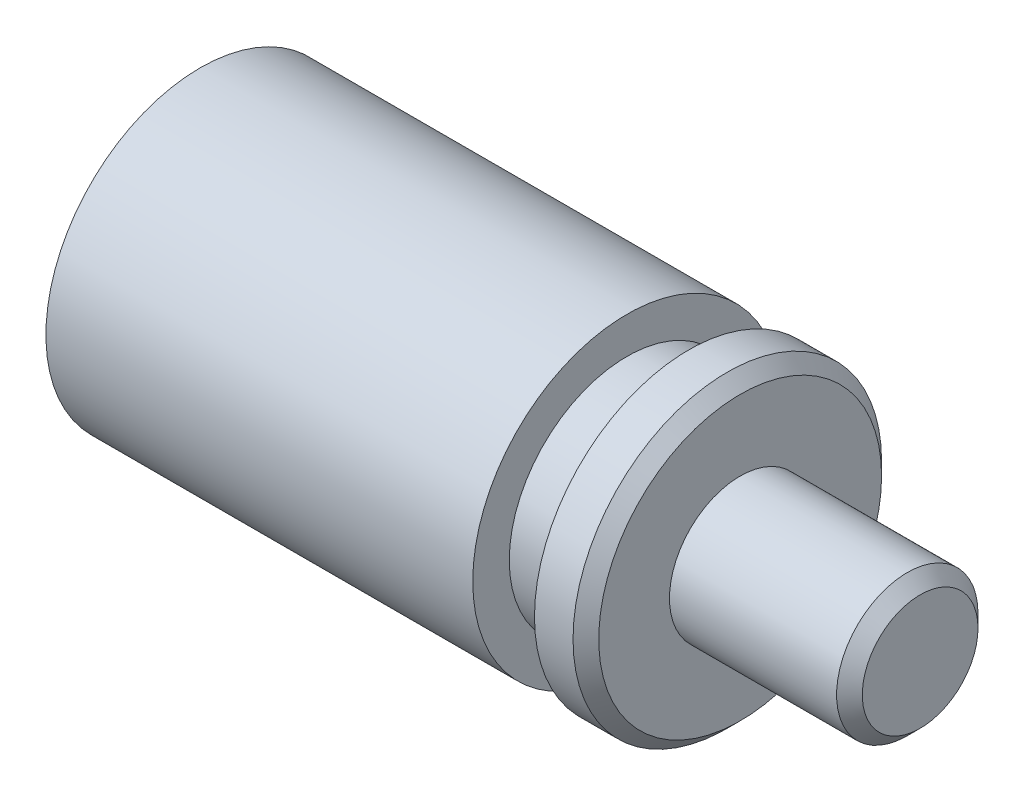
ISO-10303-21;
HEADER;
FILE_DESCRIPTION(('STEP AP214'),'2;1');
FILE_NAME('part.step','',(''),(''),'','','');
FILE_SCHEMA(('AUTOMOTIVE_DESIGN { 1 0 10303 214 1 1 1 1 }'));
ENDSEC;
DATA;
#1=APPLICATION_CONTEXT('core data for automotive mechanical design processes');
#2=APPLICATION_PROTOCOL_DEFINITION('international standard','automotive_design',2000,#1);
#3=PRODUCT_CONTEXT('',#1,'mechanical');
#4=PRODUCT('Part','Part','',(#3));
#5=PRODUCT_RELATED_PRODUCT_CATEGORY('part','',(#4));
#6=PRODUCT_DEFINITION_FORMATION('','',#4);
#7=PRODUCT_DEFINITION_CONTEXT('part definition',#1,'design');
#8=PRODUCT_DEFINITION('design','',#6,#7);
#9=PRODUCT_DEFINITION_SHAPE('','',#8);
#10=(LENGTH_UNIT() NAMED_UNIT(*) SI_UNIT(.MILLI.,.METRE.));
#11=(NAMED_UNIT(*) PLANE_ANGLE_UNIT() SI_UNIT($,.RADIAN.));
#12=(NAMED_UNIT(*) SI_UNIT($,.STERADIAN.) SOLID_ANGLE_UNIT());
#13=UNCERTAINTY_MEASURE_WITH_UNIT(LENGTH_MEASURE(1.E-05),#10,'distance_accuracy_value','');
#14=(GEOMETRIC_REPRESENTATION_CONTEXT(3) GLOBAL_UNCERTAINTY_ASSIGNED_CONTEXT((#13)) GLOBAL_UNIT_ASSIGNED_CONTEXT((#10,
#11,#12)) REPRESENTATION_CONTEXT('',''));
#15=CARTESIAN_POINT('',(0.,0.,0.));
#16=DIRECTION('',(0.,0.,1.));
#17=DIRECTION('',(1.,0.,0.));
#18=AXIS2_PLACEMENT_3D('',#15,#16,#17);
#19=CARTESIAN_POINT('',(0.,0.,0.));
#20=DIRECTION('',(1.,0.,0.));
#21=DIRECTION('',(0.,0.,-1.));
#22=AXIS2_PLACEMENT_3D('',#19,#20,#21);
#23=PLANE('',#22);
#24=CARTESIAN_POINT('',(0.,0.,0.));
#25=DIRECTION('',(1.,0.,0.));
#26=DIRECTION('',(0.,0.,-1.));
#27=AXIS2_PLACEMENT_3D('',#24,#25,#26);
#28=CIRCLE('',#27,2.25);
#29=CARTESIAN_POINT('',(0.,0.,-2.25));
#30=VERTEX_POINT('',#29);
#31=EDGE_CURVE('E46',#30,#30,#28,.T.);
#32=ORIENTED_EDGE('',*,*,#31,.T.);
#33=EDGE_LOOP('',(#32));
#34=FACE_BOUND('',#33,.T.);
#35=ADVANCED_FACE('F32',(#34),#23,.T.);
#36=CARTESIAN_POINT('',(0.,0.,0.));
#37=DIRECTION('',(1.,0.,0.));
#38=DIRECTION('',(0.,0.,-1.));
#39=AXIS2_PLACEMENT_3D('',#36,#37,#38);
#40=CYLINDRICAL_SURFACE('',#39,2.75);
#41=CARTESIAN_POINT('',(-0.5,0.,0.));
#42=DIRECTION('',(1.,0.,0.));
#43=DIRECTION('',(0.,0.,-1.));
#44=AXIS2_PLACEMENT_3D('',#41,#42,#43);
#45=CIRCLE('',#44,2.75);
#46=CARTESIAN_POINT('',(-0.5,0.,-2.75));
#47=VERTEX_POINT('',#46);
#48=EDGE_CURVE('E42',#47,#47,#45,.F.);
#49=ORIENTED_EDGE('',*,*,#48,.T.);
#50=EDGE_LOOP('',(#49));
#51=FACE_BOUND('',#50,.T.);
#52=CARTESIAN_POINT('',(-7.00000000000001,0.,0.));
#53=DIRECTION('',(1.,0.,0.));
#54=DIRECTION('',(0.,0.,-1.));
#55=AXIS2_PLACEMENT_3D('',#52,#53,#54);
#56=CIRCLE('',#55,2.75);
#57=CARTESIAN_POINT('',(-7.00000000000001,0.,-2.75));
#58=VERTEX_POINT('',#57);
#59=EDGE_CURVE('E51',#58,#58,#56,.T.);
#60=ORIENTED_EDGE('',*,*,#59,.T.);
#61=EDGE_LOOP('',(#60));
#62=FACE_BOUND('',#61,.T.);
#63=ADVANCED_FACE('F87',(#51,#62),#40,.T.);
#64=CARTESIAN_POINT('',(-7.00000000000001,2.74999999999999,0.));
#65=DIRECTION('',(1.,0.,0.));
#66=DIRECTION('',(0.,0.,-1.));
#67=AXIS2_PLACEMENT_3D('',#64,#65,#66);
#68=PLANE('',#67);
#69=CARTESIAN_POINT('',(-7.00000000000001,0.,0.));
#70=DIRECTION('',(1.,0.,0.));
#71=DIRECTION('',(0.,0.,-1.));
#72=AXIS2_PLACEMENT_3D('',#69,#70,#71);
#73=CIRCLE('',#72,5.5);
#74=CARTESIAN_POINT('',(-7.00000000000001,0.,-5.5));
#75=VERTEX_POINT('',#74);
#76=EDGE_CURVE('E38',#75,#75,#73,.T.);
#77=ORIENTED_EDGE('',*,*,#76,.T.);
#78=EDGE_LOOP('',(#77));
#79=FACE_BOUND('',#78,.T.);
#80=ORIENTED_EDGE('',*,*,#59,.F.);
#81=EDGE_LOOP('',(#80));
#82=FACE_BOUND('',#81,.T.);
#83=ADVANCED_FACE('F92',(#79,#82),#68,.T.);
#84=CARTESIAN_POINT('',(0.,0.,0.));
#85=DIRECTION('',(1.,0.,0.));
#86=DIRECTION('',(0.,0.,-1.));
#87=AXIS2_PLACEMENT_3D('',#84,#85,#86);
#88=CYLINDRICAL_SURFACE('',#87,6.);
#89=CARTESIAN_POINT('',(-7.50000000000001,0.,0.));
#90=DIRECTION('',(1.,0.,0.));
#91=DIRECTION('',(0.,0.,-1.));
#92=AXIS2_PLACEMENT_3D('',#89,#90,#91);
#93=CIRCLE('',#92,6.);
#94=CARTESIAN_POINT('',(-7.50000000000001,0.,-6.));
#95=VERTEX_POINT('',#94);
#96=EDGE_CURVE('E12',#95,#95,#93,.F.);
#97=ORIENTED_EDGE('',*,*,#96,.T.);
#98=EDGE_LOOP('',(#97));
#99=FACE_BOUND('',#98,.T.);
#100=CARTESIAN_POINT('',(-9.00000000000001,0.,0.));
#101=DIRECTION('',(1.,0.,0.));
#102=DIRECTION('',(0.,0.,-1.));
#103=AXIS2_PLACEMENT_3D('',#100,#101,#102);
#104=CIRCLE('',#103,6.);
#105=CARTESIAN_POINT('',(-9.00000000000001,0.,-6.));
#106=VERTEX_POINT('',#105);
#107=EDGE_CURVE('E54',#106,#106,#104,.T.);
#108=ORIENTED_EDGE('',*,*,#107,.T.);
#109=EDGE_LOOP('',(#108));
#110=FACE_BOUND('',#109,.T.);
#111=ADVANCED_FACE('F99',(#99,#110),#88,.T.);
#112=CARTESIAN_POINT('',(-9.00000000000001,6.,0.));
#113=DIRECTION('',(-1.,0.,0.));
#114=DIRECTION('',(0.,0.,1.));
#115=AXIS2_PLACEMENT_3D('',#112,#113,#114);
#116=PLANE('',#115);
#117=CARTESIAN_POINT('',(-9.00000000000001,0.,0.));
#118=DIRECTION('',(1.,0.,0.));
#119=DIRECTION('',(0.,0.,-1.));
#120=AXIS2_PLACEMENT_3D('',#117,#118,#119);
#121=CIRCLE('',#120,4.58);
#122=CARTESIAN_POINT('',(-9.00000000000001,0.,-4.58));
#123=VERTEX_POINT('',#122);
#124=EDGE_CURVE('E57',#123,#123,#121,.T.);
#125=ORIENTED_EDGE('',*,*,#124,.T.);
#126=EDGE_LOOP('',(#125));
#127=FACE_BOUND('',#126,.T.);
#128=ORIENTED_EDGE('',*,*,#107,.F.);
#129=EDGE_LOOP('',(#128));
#130=FACE_BOUND('',#129,.T.);
#131=ADVANCED_FACE('F105',(#127,#130),#116,.T.);
#132=CARTESIAN_POINT('',(0.,0.,0.));
#133=DIRECTION('',(1.,0.,0.));
#134=DIRECTION('',(0.,0.,-1.));
#135=AXIS2_PLACEMENT_3D('',#132,#133,#134);
#136=CYLINDRICAL_SURFACE('',#135,4.58);
#137=CARTESIAN_POINT('',(-11.4,0.,0.));
#138=DIRECTION('',(1.,0.,0.));
#139=DIRECTION('',(0.,0.,-1.));
#140=AXIS2_PLACEMENT_3D('',#137,#138,#139);
#141=CIRCLE('',#140,4.58);
#142=CARTESIAN_POINT('',(-11.4,0.,-4.58));
#143=VERTEX_POINT('',#142);
#144=EDGE_CURVE('E60',#143,#143,#141,.T.);
#145=ORIENTED_EDGE('',*,*,#144,.T.);
#146=EDGE_LOOP('',(#145));
#147=FACE_BOUND('',#146,.T.);
#148=ORIENTED_EDGE('',*,*,#124,.F.);
#149=EDGE_LOOP('',(#148));
#150=FACE_BOUND('',#149,.T.);
#151=ADVANCED_FACE('F108',(#147,#150),#136,.T.);
#152=CARTESIAN_POINT('',(-11.4,4.58,0.));
#153=DIRECTION('',(1.,0.,0.));
#154=DIRECTION('',(0.,0.,-1.));
#155=AXIS2_PLACEMENT_3D('',#152,#153,#154);
#156=PLANE('',#155);
#157=CARTESIAN_POINT('',(-11.4,0.,0.));
#158=DIRECTION('',(1.,0.,0.));
#159=DIRECTION('',(0.,0.,-1.));
#160=AXIS2_PLACEMENT_3D('',#157,#158,#159);
#161=CIRCLE('',#160,6.);
#162=CARTESIAN_POINT('',(-11.4,0.,-6.));
#163=VERTEX_POINT('',#162);
#164=EDGE_CURVE('E63',#163,#163,#161,.T.);
#165=ORIENTED_EDGE('',*,*,#164,.T.);
#166=EDGE_LOOP('',(#165));
#167=FACE_BOUND('',#166,.T.);
#168=ORIENTED_EDGE('',*,*,#144,.F.);
#169=EDGE_LOOP('',(#168));
#170=FACE_BOUND('',#169,.T.);
#171=ADVANCED_FACE('F84',(#167,#170),#156,.T.);
#172=CARTESIAN_POINT('',(0.,0.,0.));
#173=DIRECTION('',(1.,0.,0.));
#174=DIRECTION('',(0.,0.,-1.));
#175=AXIS2_PLACEMENT_3D('',#172,#173,#174);
#176=CYLINDRICAL_SURFACE('',#175,6.);
#177=CARTESIAN_POINT('',(-28.,0.,0.));
#178=DIRECTION('',(1.,0.,0.));
#179=DIRECTION('',(0.,0.,-1.));
#180=AXIS2_PLACEMENT_3D('',#177,#178,#179);
#181=CIRCLE('',#180,6.);
#182=CARTESIAN_POINT('',(-28.,0.,-6.));
#183=VERTEX_POINT('',#182);
#184=EDGE_CURVE('E66',#183,#183,#181,.T.);
#185=ORIENTED_EDGE('',*,*,#184,.T.);
#186=EDGE_LOOP('',(#185));
#187=FACE_BOUND('',#186,.T.);
#188=ORIENTED_EDGE('',*,*,#164,.F.);
#189=EDGE_LOOP('',(#188));
#190=FACE_BOUND('',#189,.T.);
#191=ADVANCED_FACE('F70',(#187,#190),#176,.T.);
#192=CARTESIAN_POINT('',(-20.,0.,0.));
#193=DIRECTION('',(1.,0.,0.));
#194=DIRECTION('',(0.,1.,0.));
#195=AXIS2_PLACEMENT_3D('',#192,#193,#194);
#196=SPHERICAL_SURFACE('',#195,10.);
#197=ORIENTED_EDGE('',*,*,#184,.F.);
#198=EDGE_LOOP('',(#197));
#199=FACE_BOUND('',#198,.T.);
#200=ADVANCED_FACE('F73',(#199),#196,.T.);
#201=CARTESIAN_POINT('',(0.,0.,0.));
#202=DIRECTION('',(-1.,0.,0.));
#203=DIRECTION('',(0.,0.,1.));
#204=AXIS2_PLACEMENT_3D('',#201,#202,#203);
#205=CONICAL_SURFACE('',#204,2.25,0.785398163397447);
#206=ORIENTED_EDGE('',*,*,#48,.F.);
#207=EDGE_LOOP('',(#206));
#208=FACE_BOUND('',#207,.T.);
#209=ORIENTED_EDGE('',*,*,#31,.F.);
#210=EDGE_LOOP('',(#209));
#211=FACE_BOUND('',#210,.T.);
#212=ADVANCED_FACE('F75',(#208,#211),#205,.T.);
#213=CARTESIAN_POINT('',(-7.00000000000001,0.,0.));
#214=DIRECTION('',(-1.,0.,0.));
#215=DIRECTION('',(0.,0.,1.));
#216=AXIS2_PLACEMENT_3D('',#213,#214,#215);
#217=CONICAL_SURFACE('',#216,5.5,0.785398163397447);
#218=ORIENTED_EDGE('',*,*,#96,.F.);
#219=EDGE_LOOP('',(#218));
#220=FACE_BOUND('',#219,.T.);
#221=ORIENTED_EDGE('',*,*,#76,.F.);
#222=EDGE_LOOP('',(#221));
#223=FACE_BOUND('',#222,.T.);
#224=ADVANCED_FACE('F81',(#220,#223),#217,.T.);
#225=CLOSED_SHELL('',(#35,#63,#83,#111,#131,#151,#171,#191,#200,#212,#224));
#226=MANIFOLD_SOLID_BREP('B2',#225);
#227=ADVANCED_BREP_SHAPE_REPRESENTATION('',(#18,#226),#14);
#228=SHAPE_DEFINITION_REPRESENTATION(#9,#227);
ENDSEC;
END-ISO-10303-21;
